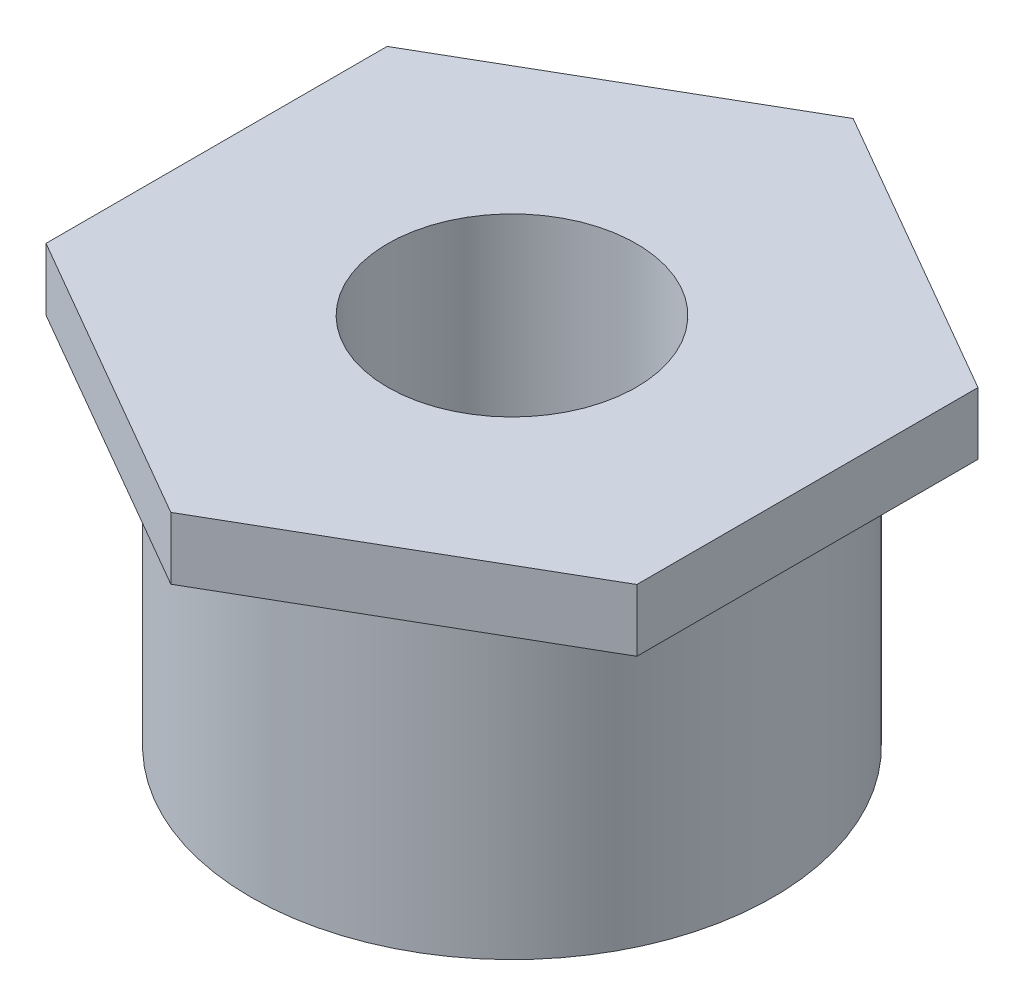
from build123d import *

# Parameters (mm, degrees)
SKETCH_1_R      = 2.1
SKETCH_1_R_2    = 1
EXTRUDE_1_DEPTH = 3
SKETCH_2_R      = 2.1
EXTRUDE_2_DEPTH = 0.5


with BuildPart() as part:
    # Sketch 1 → Extrude 1 (new body)
    with BuildSketch(Plane(origin=(0, 0, 0), x_dir=(1, 0, 0), z_dir=(0, 1, 0))):
        with Locations(Location((0, 0, 0), (0, 0, 270))):
            Circle(SKETCH_1_R)
        with Locations(Location((0, 0, 0), (0, 0, 270))):
            Circle(SKETCH_1_R_2, mode=Mode.SUBTRACT)
    extrude(amount=-EXTRUDE_1_DEPTH)

    # Sketch 2 → Extrude 2 (add)
    with BuildSketch(Plane(origin=(0, 0, 0), x_dir=(1, 0, 0), z_dir=(0, 1, 0))):
        Polygon((2.375, -1.371206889), (2.375, 1.371206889), (0, 2.742413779), (-2.375, 1.371206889), (-2.375, -1.371206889), (0, -2.742413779), align=None)
        with Locations(Location((0, 0, 0), (0, 0, 270))):
            Circle(SKETCH_2_R, mode=Mode.SUBTRACT)
    extrude(amount=-EXTRUDE_2_DEPTH)


solid = part.part
